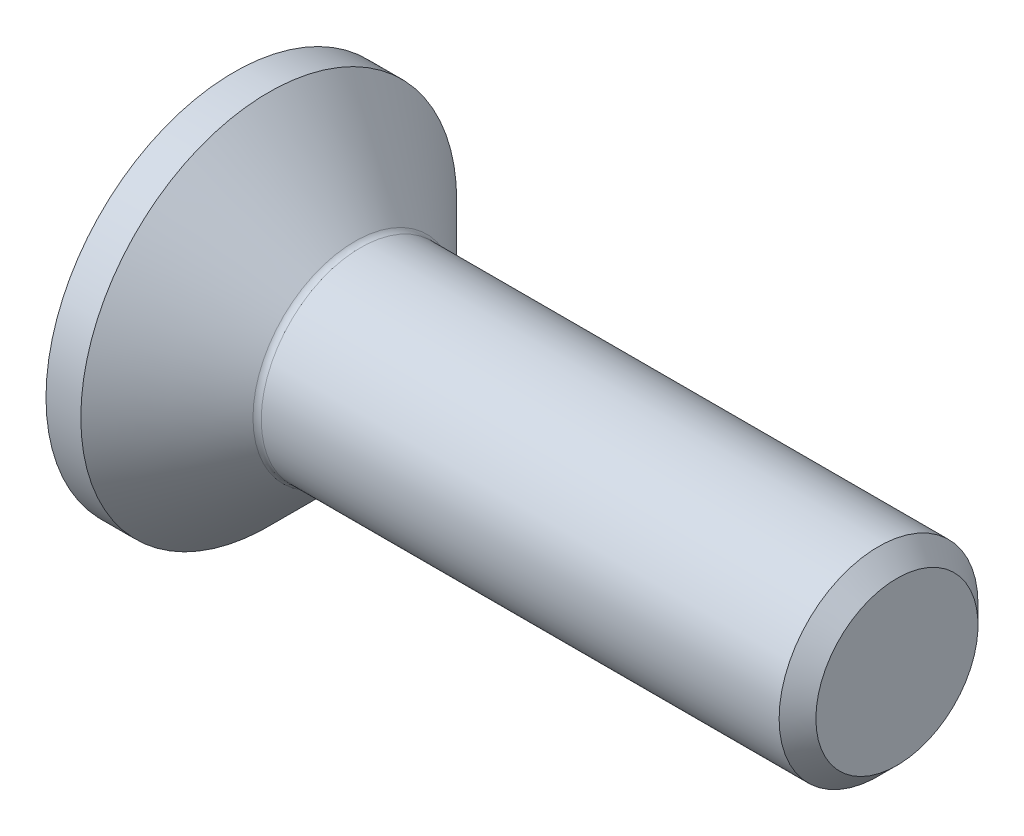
from build123d import *

# Parameters (mm, degrees)
FILLET1_R   = 0.25
HEX_2_DEPTH = 2.2


with BuildPart() as part:
    # BodySke → BaseBody (revolve)
    with BuildSketch(Plane.XY, mode=Mode.PRIVATE) as basebody_sk:
        Polygon((0, 0), (0, 5.67), (1.05, 5.67), (3.72, 3), (19.4455, 3), (20, 2.4455), (20, 0), align=None)
    revolve(basebody_sk.sketch.rotate(Axis((0, 0, 0), (1, 0, 0)), 90), axis=Axis((0, 0, 0), (1, 0, 0)))

    # Fillet1
    fillet1_edges = [part.edges().sort_by_distance(p)[0] for p in [
        (3.72, 0, -3),
    ]]
    fillet(fillet1_edges, radius=FILLET1_R)

    # Sketch2 → PreBroach (revolve, cut)
    with BuildSketch(Plane.XY, mode=Mode.PRIVATE) as prebroach_sk:
        Polygon((0, 2), (2.2, 2), (3.354700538, 0), (0, 0), align=None)
    revolve(prebroach_sk.sketch.rotate(Axis((0, 0, 0), (1, 0, 0)), 90), axis=Axis((0, 0, 0), (1, 0, 0)), mode=Mode.SUBTRACT)

    # Sketch3 → Hex 2 (cut)
    with BuildSketch(Plane.ZY):
        Polygon((-2, -1.154700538), (-2, 1.154700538), (0, 2.309401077), (2, 1.154700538), (2, -1.154700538), (0, -2.309401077), align=None)
    extrude(amount=-HEX_2_DEPTH, mode=Mode.SUBTRACT)


solid = part.part
